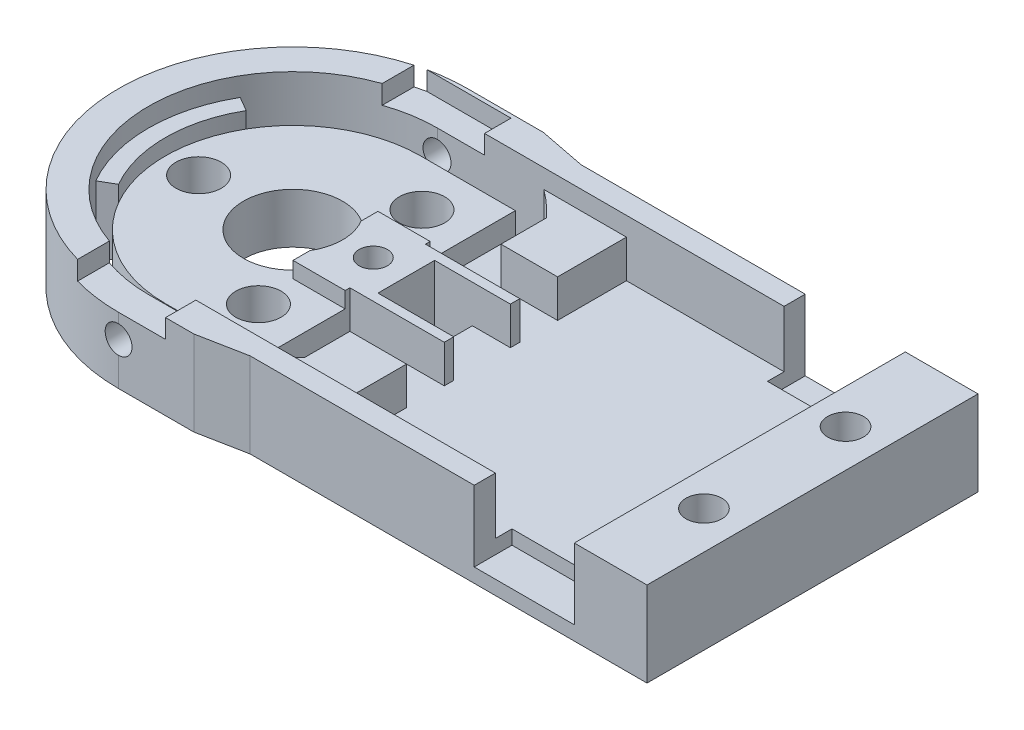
from build123d import *

# Parameters (mm, degrees)
SENSOR_BODY_BASE_DEPTH            = 9
CAMERA_HOLE_SKETCH_R              = 5.25
CAMERA_HOLE_DEPTH                 = 55.697637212
COVER_PLATE_CUTOUT_DEPTH          = 2
LED_DRIVER_CUTOUT_DEPTH           = 55.40433362
LED_DRIVER_CUTOUT_DEPTH_BACK      = 4
LEAD_START                        = 55.40433362
LEAD_CUTOUT_DEPTH                 = 62.40433362
FOLDED_LEAD_CUTOUT_DEPTH          = 4
GREEN_LEAD_CUTOUT_SKETCH_W        = 4
GREEN_LEAD_CUTOUT_SKETCH_H        = 6
GREEN_LEAD_CUTOUT_DEPTH           = 55.40433362
FOLDED_GREEN_LEAD_CUTOUT_SKETCH_W = 4.025
FOLDED_GREEN_LEAD_CUTOUT_SKETCH_H = 6
FOLDED_GREEN_LEAD_CUTOUT_DEPTH    = 4
CAMERA_PCB_CUTOUT_DEPTH           = 1.69
COVER_START                       = 1.69
COVER_PLATE_SUPPORT_DEPTH         = 1.69
EXTRUDE_START                     = -9
EXTRUDE_2_DEPTH                   = 9
SKETCH_11_R                       = 1.45
CUT_EXTRUDE_10_DEPTH              = 4
SKETCH_3_W                        = 10
SKETCH_3_H                        = 39.914546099
CUT_EXTRUDE_4_DEPTH               = 2
SKETCH_4_W                        = 35.0588586
SKETCH_4_H                        = 9
EXTRUDE_1_DEPTH                   = 4
SKETCH_5_R                        = 1.9
CUT_EXTRUDE_5_DEPTH               = 5
SKETCH_6_W                        = 10.6
SKETCH_6_H                        = 4
CUT_EXTRUDE_6_DEPTH               = 1.5
SKETCH_7_R                        = 1.25
CUT_EXTRUDE_7_DEPTH               = 59.294053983
SKETCH_8_R                        = 2.4
CUT_EXTRUDE_8_DEPTH               = 3.5


with BuildPart() as part:
    # Sensor Body Base Sketch → Sensor Body Base (new body)
    with BuildSketch(Plane(origin=(0, 0, 0), x_dir=(1, 0, 0), z_dir=(0, 1, 0))):
        with BuildLine():
            Line((0, 17.5294293), (51.025, 17.5294293))
            Line((51.025, 17.5294293), (51.025, -17.5294293))
            Line((51.025, -17.5294293), (0, -17.5294293))
            ThreePointArc((0, -17.5294293), (-17.5294293, 0), (0, 17.5294293))
        make_face()
    extrude(amount=SENSOR_BODY_BASE_DEPTH)

    # Camera Hole Sketch → Camera Hole (cut, through all)
    with BuildSketch(Plane(origin=(0, 9, 0), x_dir=(1, 0, 0), z_dir=(0, 1, 0))):
        with Locations(Location((0, 0, 0), (0, 0, 270))):
            Circle(CAMERA_HOLE_SKETCH_R)
    extrude(amount=-CAMERA_HOLE_DEPTH, mode=Mode.SUBTRACT)

    # Cover Plate Cutout Sketch → Cover Plate Cutout (cut)
    # profile 1 of 2: a face of its own
    with BuildSketch(Plane(origin=(0, 9, 0), x_dir=(1, 0, 0), z_dir=(0, 1, 0))):
        with BuildLine():
            Line((47.325, 15.29), (0, 15.29))
            ThreePointArc((0, 15.29), (-15.29, 0), (0, -15.29))
            Line((0, -15.29), (47.325, -15.29))
            Line((47.325, -15.29), (47.325, -5.29))
            Line((47.325, -5.29), (47.325, 5.29))
            Line((47.325, 5.29), (47.325, 15.29))
        make_face()
        with BuildLine():
            ThreePointArc((4.308421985, -3), (-5.25, 0), (4.308421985, 3))
            Line((4.308421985, 3), (10.72655949, 3))
            Line((10.72655949, 3), (10.72655949, -3))
            Line((10.72655949, -3), (4.308421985, -3))
        make_face(mode=Mode.SUBTRACT)
    # profile 2 of 2: a face of its own
    with BuildSketch(Plane(origin=(0, 9, 0), x_dir=(1, 0, 0), z_dir=(0, 1, 0))):
        with BuildLine():
            Line((10.72655949, 3), (4.308421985, 3))
            ThreePointArc((4.308421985, 3), (5.009077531, 1.57214576), (5.25, 0))
            ThreePointArc((5.25, 0), (5.009077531, -1.57214576), (4.308421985, -3))
            Line((4.308421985, -3), (10.72655949, -3))
            Line((10.72655949, -3), (10.72655949, 3))
        make_face()
    extrude(amount=-COVER_PLATE_CUTOUT_DEPTH, mode=Mode.SUBTRACT)

    # LED Driver Cutout Sketch → LED Driver Cutout (cut, two sides: drawn at the far end of the back side and taken through both)
    with BuildSketch(Plane(origin=(0, 7, 0), x_dir=(1, 0, 0), z_dir=(0, 1, 0)).offset(-LED_DRIVER_CUTOUT_DEPTH_BACK)):
        Polygon((36.725, -17.5294293), (47.325, -17.5294293), (47.325, 17.5294293), (36.725, 17.5294293), (36.725, 15.29), (20.025, 15.29), (20.025, -15.29), (36.725, -15.29), align=None)
    extrude(amount=LED_DRIVER_CUTOUT_DEPTH + LED_DRIVER_CUTOUT_DEPTH_BACK, mode=Mode.SUBTRACT)

    # Cover Plate Fastener Sketch → Cover Plate Fastener (revolve, cut)
    with BuildSketch(Plane.XY, mode=Mode.PRIVATE) as cover_plate_fastener_sk:
        Polygon((8.5, 7), (8.5, 3.213974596), (10, 4.08), (10, 7), align=None)
    revolve(cover_plate_fastener_sk.sketch.rotate(Axis((8.5, 7, 0), (0, -1, 0)), 90), axis=Axis((8.5, 7, 0), (0, -1, 0)), mode=Mode.SUBTRACT)

    # Lead Cutout Shared Sketch → Lead Cutout (cut)
    with BuildSketch(Plane(origin=(0, 7, 0), x_dir=(1, 0, 0), z_dir=(0, 1, 0)).offset(LEAD_START)):
        with BuildLine():
            ThreePointArc((0, -13.5294293), (-6.76471465, -11.716829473), (-11.716829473, -6.76471465))
            Line((-11.716829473, -6.76471465), (-13.241528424, -7.645))
            ThreePointArc((-13.241528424, -7.645), (-7.645, -13.241528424), (0, -15.29))
            Line((0, -15.29), (11.279002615, -15.29))
            ThreePointArc((11.279002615, -15.29), (12.340917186, -14.446513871), (13.339960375, -13.5294293))
            Line((13.339960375, -13.5294293), (10.025, -13.5294293))
            Line((10.025, -13.5294293), (0, -13.5294293))
        make_face()
    lead_cutout = extrude(amount=-LEAD_CUTOUT_DEPTH, mode=Mode.SUBTRACT)

    # Sketch11_5 → Folded Lead Cutout (cut)
    with BuildSketch(Plane(origin=(0, 7, 0), x_dir=(1, 0, 0), z_dir=(0, 1, 0))):
        with BuildLine():
            Line((10.025, -4), (10.025, -13.5294293))
            Line((10.025, -13.5294293), (13.339960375, -13.5294293))
            ThreePointArc((13.339960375, -13.5294293), (13.687104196, -13.178132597), (14.025, -12.817931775))
            Line((14.025, -12.817931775), (14.025, -8))
            Line((14.025, -8), (20.025, -8))
            Line((20.025, -8), (20.025, -4))
            Line((20.025, -4), (10.025, -4))
        make_face()
    folded_lead_cutout = extrude(amount=-FOLDED_LEAD_CUTOUT_DEPTH, mode=Mode.SUBTRACT)

    # Lead Cutout Mirror: Lead Cutout, Folded Lead Cutout across plane
    add(lead_cutout.mirror(Plane.XY), mode=Mode.SUBTRACT)
    add(folded_lead_cutout.mirror(Plane.XY), mode=Mode.SUBTRACT)

    # Green Lead Cutout Sketch → Green Lead Cutout (cut, through all)
    with BuildSketch(Plane(origin=(0, 7, 0), x_dir=(1, 0, 0), z_dir=(0, 1, 0))):
        with Locations((14, 0)):
            Rectangle(GREEN_LEAD_CUTOUT_SKETCH_W, GREEN_LEAD_CUTOUT_SKETCH_H)
    extrude(amount=-GREEN_LEAD_CUTOUT_DEPTH, mode=Mode.SUBTRACT)

    # Folded Green Lead Cutout Sketch → Folded Green Lead Cutout (cut)
    with BuildSketch(Plane(origin=(0, 7, 0), x_dir=(1, 0, 0), z_dir=(0, 1, 0))):
        with Locations((18.0125, 0)):
            Rectangle(FOLDED_GREEN_LEAD_CUTOUT_SKETCH_W, FOLDED_GREEN_LEAD_CUTOUT_SKETCH_H)
    extrude(amount=-FOLDED_GREEN_LEAD_CUTOUT_DEPTH, mode=Mode.SUBTRACT)

    # Camera PCB Cutout Sketch → Camera PCB Cutout (cut)
    with BuildSketch(Plane(origin=(0, 7, 0), x_dir=(1, 0, 0), z_dir=(0, 1, 0))):
        with BuildLine():
            Line((-11.716829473, 6.76471465), (-13.241528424, 7.645))
            ThreePointArc((-13.241528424, 7.645), (-15.29, 0), (-13.241528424, -7.645))
            Line((-13.241528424, -7.645), (-11.716829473, -6.76471465))
            ThreePointArc((-11.716829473, -6.76471465), (-6.76471465, -11.716829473), (0, -13.5294293))
            Line((0, -13.5294293), (10.025, -13.5294293))
            Line((10.025, -13.5294293), (10.025, -4.5))
            Line((10.025, -4.5), (4.5, -4.5))
            Line((4.5, -4.5), (2.704163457, -4.5))
            ThreePointArc((2.704163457, -4.5), (0, -5.25), (-2.704163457, -4.5))
            Line((-2.704163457, -4.5), (-4.5, -4.5))
            Line((-4.5, -4.5), (-4.5, -2.704163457))
            ThreePointArc((-4.5, -2.704163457), (-5.25, 0), (-4.5, 2.704163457))
            Line((-4.5, 2.704163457), (-4.5, 4.5))
            Line((-4.5, 4.5), (-2.704163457, 4.5))
            ThreePointArc((-2.704163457, 4.5), (0, 5.25), (2.704163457, 4.5))
            Line((2.704163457, 4.5), (4.5, 4.5))
            Line((4.5, 4.5), (10.025, 4.5))
            Line((10.025, 4.5), (10.025, 13.5294293))
            Line((10.025, 13.5294293), (0, 13.5294293))
            ThreePointArc((0, 13.5294293), (-6.76471465, 11.716829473), (-11.716829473, 6.76471465))
        make_face()
        with BuildLine():
            Line((4.5, -4.5), (4.5, -2.704163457))
            ThreePointArc((4.5, -2.704163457), (3.712310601, -3.712310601), (2.704163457, -4.5))
            Line((2.704163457, -4.5), (4.5, -4.5))
        make_face()
        with BuildLine():
            ThreePointArc((-2.704163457, -4.5), (-3.712310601, -3.712310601), (-4.5, -2.704163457))
            Line((-4.5, -2.704163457), (-4.5, -4.5))
            Line((-4.5, -4.5), (-2.704163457, -4.5))
        make_face()
        with BuildLine():
            ThreePointArc((-4.5, 2.704163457), (-3.712310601, 3.712310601), (-2.704163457, 4.5))
            Line((-2.704163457, 4.5), (-4.5, 4.5))
            Line((-4.5, 4.5), (-4.5, 2.704163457))
        make_face()
        with BuildLine():
            Line((4.5, 2.704163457), (4.5, 4.5))
            Line((4.5, 4.5), (2.704163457, 4.5))
            ThreePointArc((2.704163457, 4.5), (3.712310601, 3.712310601), (4.5, 2.704163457))
        make_face()
    extrude(amount=-CAMERA_PCB_CUTOUT_DEPTH, mode=Mode.SUBTRACT)

    # Cover Plate Support Sketch → Cover Plate Support (add)
    with BuildSketch(Plane(origin=(0, 5.31, 0), x_dir=(1, 0, 0), z_dir=(0, 1, 0)).offset(COVER_START)):
        with BuildLine():
            Line((-11.716829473, 6.76471465), (-13.241528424, 7.645))
            ThreePointArc((-13.241528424, 7.645), (-15.29, 0), (-13.241528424, -7.645))
            Line((-13.241528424, -7.645), (-11.716829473, -6.76471465))
            ThreePointArc((-11.716829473, -6.76471465), (-13.5294293, 0), (-11.716829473, 6.76471465))
        make_face()
    extrude(amount=-COVER_PLATE_SUPPORT_DEPTH)

    # Sketch 10 → Extrude 2 (add)
    with BuildSketch(Plane(origin=(0, 9, 0), x_dir=(1, 0, 0), z_dir=(0, 1, 0)).offset(EXTRUDE_START)):
        with BuildLine():
            Line((0, 18.5), (8, 18.5))
            Line((8, 18.5), (13, 17.5294293))
            Line((13, 17.5294293), (0, 17.5294293))
            ThreePointArc((0, 17.5294293), (-17.5294293, 0), (0, -17.5294293))
            Line((0, -17.5294293), (13, -17.5294293))
            Line((13, -17.5294293), (8, -18.5))
            Line((8, -18.5), (0, -18.5))
            ThreePointArc((0, -18.5), (-18.5, 0), (0, 18.5))
        make_face()
    extrude(amount=EXTRUDE_2_DEPTH)

    # Sketch 11 → Cut-Extrude 10 (cut)
    with BuildSketch(Plane.XY.offset(18.5)):
        with Locations(Location((0, 4.5, 0), (0, 0, 270))):
            Circle(SKETCH_11_R)
    cut_extrude_10 = extrude(amount=-CUT_EXTRUDE_10_DEPTH, mode=Mode.SUBTRACT)

    # Mirror 1: Cut-Extrude 10 across plane
    add(cut_extrude_10.mirror(Plane.XY), mode=Mode.SUBTRACT)

    # Sketch 3 → Cut-Extrude 4 (cut)
    with BuildSketch(Plane(origin=(0, 9, 0), x_dir=(1, 0, 0), z_dir=(0, 1, 0))):
        with Locations((0, -1.868187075)):
            Rectangle(SKETCH_3_W, SKETCH_3_H)
    extrude(amount=-CUT_EXTRUDE_4_DEPTH, mode=Mode.SUBTRACT)

    # Sketch 4 → Extrude 1 (add)
    with BuildSketch(Plane(origin=(51.025, 0, 0), x_dir=(0, 0, -1), z_dir=(1, 0, 0))):
        with Locations((0, 4.5)):
            Rectangle(SKETCH_4_W, SKETCH_4_H)
    extrude(amount=EXTRUDE_1_DEPTH)

    # Sketch 5 → Cut-Extrude 5 (cut)
    with BuildSketch(Plane(origin=(0, 9, 0), x_dir=(1, 0, 0), z_dir=(0, 1, 0))):
        with Locations(Location((51.025, -7.5, 0), (0, 0, 270))):
            Circle(SKETCH_5_R)
        with Locations(Location((51.025, 7.5, 0), (0, 0, 270))):
            Circle(SKETCH_5_R)
    extrude(amount=-CUT_EXTRUDE_5_DEPTH, mode=Mode.SUBTRACT)

    # Sketch 6 → Cut-Extrude 6 (cut)
    with BuildSketch(Plane(origin=(0, 3, 0), x_dir=(1, 0, 0), z_dir=(0, 1, 0))):
        with Locations((42.025, -15.5294293)):
            Rectangle(SKETCH_6_W, SKETCH_6_H)
        with Locations((42.025, 15.5294293)):
            Rectangle(SKETCH_6_W, SKETCH_6_H)
    extrude(amount=-CUT_EXTRUDE_6_DEPTH, mode=Mode.SUBTRACT)

    # Sketch 7 → Cut-Extrude 7 (cut, through all)
    with BuildSketch(Plane(origin=(0, 5.31, 0), x_dir=(1, 0, 0), z_dir=(0, 1, 0))):
        with Locations(Location((5, -8.660254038, 0), (0, 0, 270))):
            Circle(SKETCH_7_R)
        with Locations(Location((5, 8.660254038, 0), (0, 0, 270))):
            Circle(SKETCH_7_R)
        with Locations(Location((-10, 0, 0), (0, 0, 270))):
            Circle(SKETCH_7_R)
    extrude(amount=-CUT_EXTRUDE_7_DEPTH, mode=Mode.SUBTRACT)

    # Sketch 8 → Cut-Extrude 8 (cut)
    with BuildSketch(Plane(origin=(0, 5.31, 0), x_dir=(1, 0, 0), z_dir=(0, 1, 0))):
        with Locations(Location((5, 8.660254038, 0), (0, 0, 270))):
            Circle(SKETCH_8_R)
        with Locations(Location((5, -8.660254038, 0), (0, 0, 270))):
            Circle(SKETCH_8_R)
        with Locations(Location((-10, 0, 0), (0, 0, 270))):
            Circle(SKETCH_8_R)
    extrude(amount=-CUT_EXTRUDE_8_DEPTH, mode=Mode.SUBTRACT)


solid = part.part
